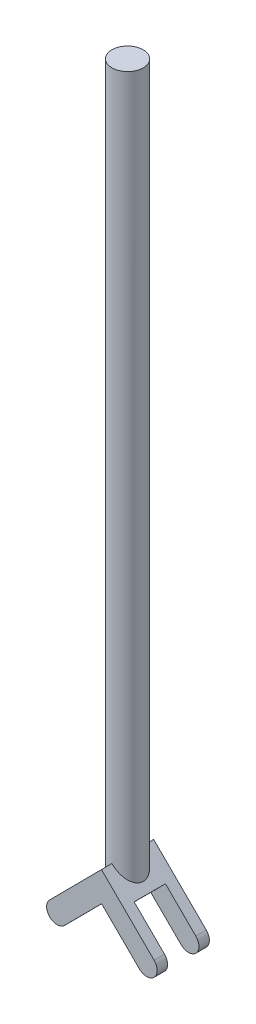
from build123d import *

# Parameters (mm, degrees)
BOSS_EXTRUDE1_DEPTH = 31.75
SKETCH3_W           = 19.05
SKETCH3_H           = 32.028916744
CUT_EXTRUDE1_DEPTH  = 64.012450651
SKETCH4_W           = 32.372985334
SKETCH4_H           = 19.05
CUT_EXTRUDE2_DEPTH  = 64.012450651
SKETCH5_R           = 9.525
BOSS_EXTRUDE2_DEPTH = 431.8


with BuildPart() as part:
    # Sketch2 → Boss-Extrude1 (new body)
    with BuildSketch(Plane.XY):
        with BuildLine():
            Line((0, 0), (-31.506708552, -31.749067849))
            ThreePointArc((-31.506708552, -31.749067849), (-31.472301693, -40.729258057), (-22.492111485, -40.694851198))
            Line((-22.492111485, -40.694851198), (0.068813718, -17.960380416))
            Line((0.068813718, -17.960380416), (23.047508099, -40.763664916))
            ThreePointArc((23.047508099, -40.763664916), (32.027698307, -40.729258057), (31.993291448, -31.749067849))
            Line((31.993291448, -31.749067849), (0, 0))
        make_face()
    extrude(amount=BOSS_EXTRUDE1_DEPTH)

    # Sketch3 → Cut-Extrude1 (cut, through all)
    with BuildSketch(Plane(origin=(0, 0, 0), x_dir=(0, 0, 1), z_dir=(-0.709810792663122, 0.7043923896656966, 0))):
        with Locations((15.875, -35.064458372)):
            Rectangle(SKETCH3_W, SKETCH3_H)
    extrude(amount=-CUT_EXTRUDE1_DEPTH, mode=Mode.SUBTRACT)

    # Sketch4 → Cut-Extrude2 (cut, through all)
    with BuildSketch(Plane(origin=(0, 0, 0), x_dir=(0.7098107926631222, -0.7043923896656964, 0), z_dir=(0.7043923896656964, 0.7098107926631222, 0))):
        with Locations((35.236492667, -15.875)):
            Rectangle(SKETCH4_W, SKETCH4_H)
    extrude(amount=-CUT_EXTRUDE2_DEPTH, mode=Mode.SUBTRACT)

    # Sketch5 → Boss-Extrude2 (add)
    with BuildSketch(Plane(origin=(0, -12.7, 0), x_dir=(1, 0, 0), z_dir=(0, 1, 0))):
        with Locations(Location((0, -15.875, 0), (0, 0, 270))):
            Circle(SKETCH5_R)
    extrude(amount=BOSS_EXTRUDE2_DEPTH)


solid = part.part
